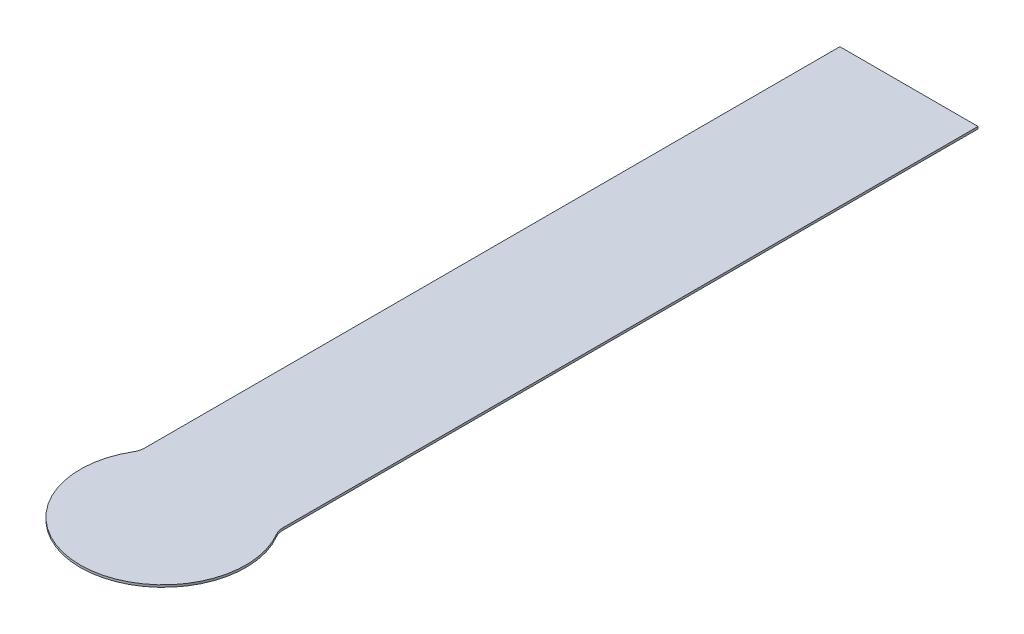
ISO-10303-21;
HEADER;
FILE_DESCRIPTION(('STEP AP214'),'2;1');
FILE_NAME('part.step','',(''),(''),'','','');
FILE_SCHEMA(('AUTOMOTIVE_DESIGN { 1 0 10303 214 1 1 1 1 }'));
ENDSEC;
DATA;
#1=APPLICATION_CONTEXT('core data for automotive mechanical design processes');
#2=APPLICATION_PROTOCOL_DEFINITION('international standard','automotive_design',2000,#1);
#3=PRODUCT_CONTEXT('',#1,'mechanical');
#4=PRODUCT('Part','Part','',(#3));
#5=PRODUCT_RELATED_PRODUCT_CATEGORY('part','',(#4));
#6=PRODUCT_DEFINITION_FORMATION('','',#4);
#7=PRODUCT_DEFINITION_CONTEXT('part definition',#1,'design');
#8=PRODUCT_DEFINITION('design','',#6,#7);
#9=PRODUCT_DEFINITION_SHAPE('','',#8);
#10=(LENGTH_UNIT() NAMED_UNIT(*) SI_UNIT(.MILLI.,.METRE.));
#11=(NAMED_UNIT(*) PLANE_ANGLE_UNIT() SI_UNIT($,.RADIAN.));
#12=(NAMED_UNIT(*) SI_UNIT($,.STERADIAN.) SOLID_ANGLE_UNIT());
#13=UNCERTAINTY_MEASURE_WITH_UNIT(LENGTH_MEASURE(1.E-05),#10,'distance_accuracy_value','');
#14=(GEOMETRIC_REPRESENTATION_CONTEXT(3) GLOBAL_UNCERTAINTY_ASSIGNED_CONTEXT((#13)) GLOBAL_UNIT_ASSIGNED_CONTEXT((#10,
#11,#12)) REPRESENTATION_CONTEXT('',''));
#15=CARTESIAN_POINT('',(0.,0.,0.));
#16=DIRECTION('',(0.,0.,1.));
#17=DIRECTION('',(1.,0.,0.));
#18=AXIS2_PLACEMENT_3D('',#15,#16,#17);
#19=CARTESIAN_POINT('',(3.98779999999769,0.1016,-2.33831798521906));
#20=DIRECTION('',(0.,-1.,0.));
#21=DIRECTION('',(0.,0.,-1.));
#22=AXIS2_PLACEMENT_3D('',#19,#20,#21);
#23=CYLINDRICAL_SURFACE('',#22,0.812799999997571);
#24=CARTESIAN_POINT('',(3.98779999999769,0.,-2.33831798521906));
#25=DIRECTION('',(0.,1.,0.));
#26=DIRECTION('',(0.,0.,1.));
#27=AXIS2_PLACEMENT_3D('',#24,#25,#26);
#28=CIRCLE('',#27,0.812799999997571);
#29=CARTESIAN_POINT('',(3.17500000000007,0.,-2.33831798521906));
#30=VERTEX_POINT('',#29);
#31=CARTESIAN_POINT('',(3.28664835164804,0.,-1.92718515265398));
#32=VERTEX_POINT('',#31);
#33=EDGE_CURVE('E111',#30,#32,#28,.T.);
#34=ORIENTED_EDGE('',*,*,#33,.F.);
#35=DIRECTION('',(0.,-1.,0.));
#36=VECTOR('',#35,1.);
#37=CARTESIAN_POINT('',(3.17500000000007,0.1016,-2.33831798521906));
#38=LINE('',#37,#36);
#39=CARTESIAN_POINT('',(3.17500000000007,0.1016,-2.33831798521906));
#40=VERTEX_POINT('',#39);
#41=EDGE_CURVE('E11',#40,#30,#38,.T.);
#42=ORIENTED_EDGE('',*,*,#41,.F.);
#43=CARTESIAN_POINT('',(3.98779999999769,0.1016,-2.33831798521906));
#44=DIRECTION('',(0.,1.,0.));
#45=DIRECTION('',(0.,0.,1.));
#46=AXIS2_PLACEMENT_3D('',#43,#44,#45);
#47=CIRCLE('',#46,0.812799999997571);
#48=CARTESIAN_POINT('',(3.28664835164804,0.1016,-1.92718515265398));
#49=VERTEX_POINT('',#48);
#50=EDGE_CURVE('E124',#40,#49,#47,.T.);
#51=ORIENTED_EDGE('',*,*,#50,.T.);
#52=DIRECTION('',(0.,-1.,0.));
#53=VECTOR('',#52,1.);
#54=CARTESIAN_POINT('',(3.28664835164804,0.1016,-1.92718515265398));
#55=LINE('',#54,#53);
#56=EDGE_CURVE('E74',#49,#32,#55,.T.);
#57=ORIENTED_EDGE('',*,*,#56,.T.);
#58=EDGE_LOOP('',(#34,#42,#51,#57));
#59=FACE_BOUND('',#58,.T.);
#60=ADVANCED_FACE('F30',(#59),#23,.F.);
#61=CARTESIAN_POINT('',(3.17500000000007,0.1016,-14.4459347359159));
#62=DIRECTION('',(-1.,0.,0.));
#63=DIRECTION('',(0.,0.,1.));
#64=AXIS2_PLACEMENT_3D('',#61,#62,#63);
#65=PLANE('',#64);
#66=DIRECTION('',(0.,0.,-1.));
#67=VECTOR('',#66,1.);
#68=CARTESIAN_POINT('',(3.17500000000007,0.,-14.4459347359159));
#69=LINE('',#68,#67);
#70=CARTESIAN_POINT('',(3.17500000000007,0.,-34.2900000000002));
#71=VERTEX_POINT('',#70);
#72=EDGE_CURVE('E114',#30,#71,#69,.T.);
#73=ORIENTED_EDGE('',*,*,#72,.T.);
#74=DIRECTION('',(0.,-1.,0.));
#75=VECTOR('',#74,1.);
#76=CARTESIAN_POINT('',(3.17500000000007,0.1016,-34.2900000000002));
#77=LINE('',#76,#75);
#78=CARTESIAN_POINT('',(3.17500000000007,0.1016,-34.2900000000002));
#79=VERTEX_POINT('',#78);
#80=EDGE_CURVE('E38',#79,#71,#77,.T.);
#81=ORIENTED_EDGE('',*,*,#80,.F.);
#82=DIRECTION('',(0.,0.,-1.));
#83=VECTOR('',#82,1.);
#84=CARTESIAN_POINT('',(3.17500000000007,0.1016,-14.4459347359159));
#85=LINE('',#84,#83);
#86=EDGE_CURVE('E137',#40,#79,#85,.T.);
#87=ORIENTED_EDGE('',*,*,#86,.F.);
#88=ORIENTED_EDGE('',*,*,#41,.T.);
#89=EDGE_LOOP('',(#73,#81,#87,#88));
#90=FACE_BOUND('',#89,.T.);
#91=ADVANCED_FACE('F140',(#90),#65,.F.);
#92=CARTESIAN_POINT('',(-31.4975858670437,0.1016,-34.2900000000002));
#93=DIRECTION('',(0.,0.,1.));
#94=DIRECTION('',(1.,0.,0.));
#95=AXIS2_PLACEMENT_3D('',#92,#93,#94);
#96=PLANE('',#95);
#97=DIRECTION('',(-1.,0.,0.));
#98=VECTOR('',#97,1.);
#99=CARTESIAN_POINT('',(-31.4975858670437,0.,-34.2900000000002));
#100=LINE('',#99,#98);
#101=CARTESIAN_POINT('',(-3.17499999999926,0.,-34.2900000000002));
#102=VERTEX_POINT('',#101);
#103=EDGE_CURVE('E116',#71,#102,#100,.T.);
#104=ORIENTED_EDGE('',*,*,#103,.T.);
#105=DIRECTION('',(0.,-1.,0.));
#106=VECTOR('',#105,1.);
#107=CARTESIAN_POINT('',(-3.17499999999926,0.1016,-34.2900000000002));
#108=LINE('',#107,#106);
#109=CARTESIAN_POINT('',(-3.17499999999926,0.1016,-34.2900000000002));
#110=VERTEX_POINT('',#109);
#111=EDGE_CURVE('E98',#110,#102,#108,.T.);
#112=ORIENTED_EDGE('',*,*,#111,.F.);
#113=DIRECTION('',(-1.,0.,0.));
#114=VECTOR('',#113,1.);
#115=CARTESIAN_POINT('',(-31.4975858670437,0.1016,-34.2900000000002));
#116=LINE('',#115,#114);
#117=EDGE_CURVE('E103',#79,#110,#116,.T.);
#118=ORIENTED_EDGE('',*,*,#117,.F.);
#119=ORIENTED_EDGE('',*,*,#80,.T.);
#120=EDGE_LOOP('',(#104,#112,#118,#119));
#121=FACE_BOUND('',#120,.T.);
#122=ADVANCED_FACE('F131',(#121),#96,.F.);
#123=CARTESIAN_POINT('',(-3.17499999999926,0.1016,-14.4459347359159));
#124=DIRECTION('',(-1.,0.,0.));
#125=DIRECTION('',(0.,0.,1.));
#126=AXIS2_PLACEMENT_3D('',#123,#124,#125);
#127=PLANE('',#126);
#128=DIRECTION('',(0.,0.,-1.));
#129=VECTOR('',#128,1.);
#130=CARTESIAN_POINT('',(-3.17499999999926,0.,-14.4459347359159));
#131=LINE('',#130,#129);
#132=CARTESIAN_POINT('',(-3.17499999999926,0.,-2.33831798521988));
#133=VERTEX_POINT('',#132);
#134=EDGE_CURVE('E93',#133,#102,#131,.T.);
#135=ORIENTED_EDGE('',*,*,#134,.F.);
#136=DIRECTION('',(0.,-1.,0.));
#137=VECTOR('',#136,1.);
#138=CARTESIAN_POINT('',(-3.17499999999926,0.1016,-2.33831798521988));
#139=LINE('',#138,#137);
#140=CARTESIAN_POINT('',(-3.17499999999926,0.1016,-2.33831798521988));
#141=VERTEX_POINT('',#140);
#142=EDGE_CURVE('E88',#141,#133,#139,.T.);
#143=ORIENTED_EDGE('',*,*,#142,.F.);
#144=DIRECTION('',(0.,0.,-1.));
#145=VECTOR('',#144,1.);
#146=CARTESIAN_POINT('',(-3.17499999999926,0.1016,-14.4459347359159));
#147=LINE('',#146,#145);
#148=EDGE_CURVE('E91',#141,#110,#147,.T.);
#149=ORIENTED_EDGE('',*,*,#148,.T.);
#150=ORIENTED_EDGE('',*,*,#111,.T.);
#151=EDGE_LOOP('',(#135,#143,#149,#150));
#152=FACE_BOUND('',#151,.T.);
#153=ADVANCED_FACE('F90',(#152),#127,.T.);
#154=CARTESIAN_POINT('',(-3.98779999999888,0.1016,-2.33831798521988));
#155=DIRECTION('',(0.,-1.,0.));
#156=DIRECTION('',(0.,0.,-1.));
#157=AXIS2_PLACEMENT_3D('',#154,#155,#156);
#158=CYLINDRICAL_SURFACE('',#157,0.812799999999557);
#159=CARTESIAN_POINT('',(-3.98779999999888,0.,-2.33831798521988));
#160=DIRECTION('',(0.,1.,0.));
#161=DIRECTION('',(0.,0.,1.));
#162=AXIS2_PLACEMENT_3D('',#159,#160,#161);
#163=CIRCLE('',#162,0.812799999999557);
#164=CARTESIAN_POINT('',(-3.28664835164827,0.,-1.92718515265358));
#165=VERTEX_POINT('',#164);
#166=EDGE_CURVE('E120',#165,#133,#163,.T.);
#167=ORIENTED_EDGE('',*,*,#166,.F.);
#168=DIRECTION('',(0.,-1.,0.));
#169=VECTOR('',#168,1.);
#170=CARTESIAN_POINT('',(-3.28664835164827,0.1016,-1.92718515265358));
#171=LINE('',#170,#169);
#172=CARTESIAN_POINT('',(-3.28664835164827,0.1016,-1.92718515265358));
#173=VERTEX_POINT('',#172);
#174=EDGE_CURVE('E67',#173,#165,#171,.T.);
#175=ORIENTED_EDGE('',*,*,#174,.F.);
#176=CARTESIAN_POINT('',(-3.98779999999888,0.1016,-2.33831798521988));
#177=DIRECTION('',(0.,1.,0.));
#178=DIRECTION('',(0.,0.,1.));
#179=AXIS2_PLACEMENT_3D('',#176,#177,#178);
#180=CIRCLE('',#179,0.812799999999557);
#181=EDGE_CURVE('E101',#173,#141,#180,.T.);
#182=ORIENTED_EDGE('',*,*,#181,.T.);
#183=ORIENTED_EDGE('',*,*,#142,.T.);
#184=EDGE_LOOP('',(#167,#175,#182,#183));
#185=FACE_BOUND('',#184,.T.);
#186=ADVANCED_FACE('F106',(#185),#158,.F.);
#187=CARTESIAN_POINT('',(0.,0.1016,0.));
#188=DIRECTION('',(0.,-1.,0.));
#189=DIRECTION('',(0.,0.,-1.));
#190=AXIS2_PLACEMENT_3D('',#187,#188,#189);
#191=CYLINDRICAL_SURFACE('',#190,3.81000000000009);
#192=CARTESIAN_POINT('',(0.,0.,0.));
#193=DIRECTION('',(0.,1.,0.));
#194=DIRECTION('',(0.,0.,1.));
#195=AXIS2_PLACEMENT_3D('',#192,#193,#194);
#196=CIRCLE('',#195,3.81000000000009);
#197=EDGE_CURVE('E122',#165,#32,#196,.T.);
#198=ORIENTED_EDGE('',*,*,#197,.T.);
#199=ORIENTED_EDGE('',*,*,#56,.F.);
#200=CARTESIAN_POINT('',(0.,0.1016,0.));
#201=DIRECTION('',(0.,1.,0.));
#202=DIRECTION('',(0.,0.,1.));
#203=AXIS2_PLACEMENT_3D('',#200,#201,#202);
#204=CIRCLE('',#203,3.81000000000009);
#205=EDGE_CURVE('E46',#173,#49,#204,.T.);
#206=ORIENTED_EDGE('',*,*,#205,.F.);
#207=ORIENTED_EDGE('',*,*,#174,.T.);
#208=EDGE_LOOP('',(#198,#199,#206,#207));
#209=FACE_BOUND('',#208,.T.);
#210=ADVANCED_FACE('F136',(#209),#191,.T.);
#211=CARTESIAN_POINT('',(-31.4975858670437,0.1016,-14.4459347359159));
#212=DIRECTION('',(0.,1.,0.));
#213=DIRECTION('',(0.,0.,1.));
#214=AXIS2_PLACEMENT_3D('',#211,#212,#213);
#215=PLANE('',#214);
#216=ORIENTED_EDGE('',*,*,#50,.F.);
#217=ORIENTED_EDGE('',*,*,#86,.T.);
#218=ORIENTED_EDGE('',*,*,#117,.T.);
#219=ORIENTED_EDGE('',*,*,#148,.F.);
#220=ORIENTED_EDGE('',*,*,#181,.F.);
#221=ORIENTED_EDGE('',*,*,#205,.T.);
#222=EDGE_LOOP('',(#216,#217,#218,#219,#220,#221));
#223=FACE_BOUND('',#222,.T.);
#224=ADVANCED_FACE('F100',(#223),#215,.T.);
#225=CARTESIAN_POINT('',(-31.4975858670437,0.,-14.4459347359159));
#226=DIRECTION('',(0.,1.,0.));
#227=DIRECTION('',(0.,0.,1.));
#228=AXIS2_PLACEMENT_3D('',#225,#226,#227);
#229=PLANE('',#228);
#230=ORIENTED_EDGE('',*,*,#33,.T.);
#231=ORIENTED_EDGE('',*,*,#197,.F.);
#232=ORIENTED_EDGE('',*,*,#166,.T.);
#233=ORIENTED_EDGE('',*,*,#134,.T.);
#234=ORIENTED_EDGE('',*,*,#103,.F.);
#235=ORIENTED_EDGE('',*,*,#72,.F.);
#236=EDGE_LOOP('',(#230,#231,#232,#233,#234,#235));
#237=FACE_BOUND('',#236,.T.);
#238=ADVANCED_FACE('F135',(#237),#229,.F.);
#239=CLOSED_SHELL('',(#60,#91,#122,#153,#186,#210,#224,#238));
#240=MANIFOLD_SOLID_BREP('B2',#239);
#241=ADVANCED_BREP_SHAPE_REPRESENTATION('',(#18,#240),#14);
#242=SHAPE_DEFINITION_REPRESENTATION(#9,#241);
ENDSEC;
END-ISO-10303-21;
